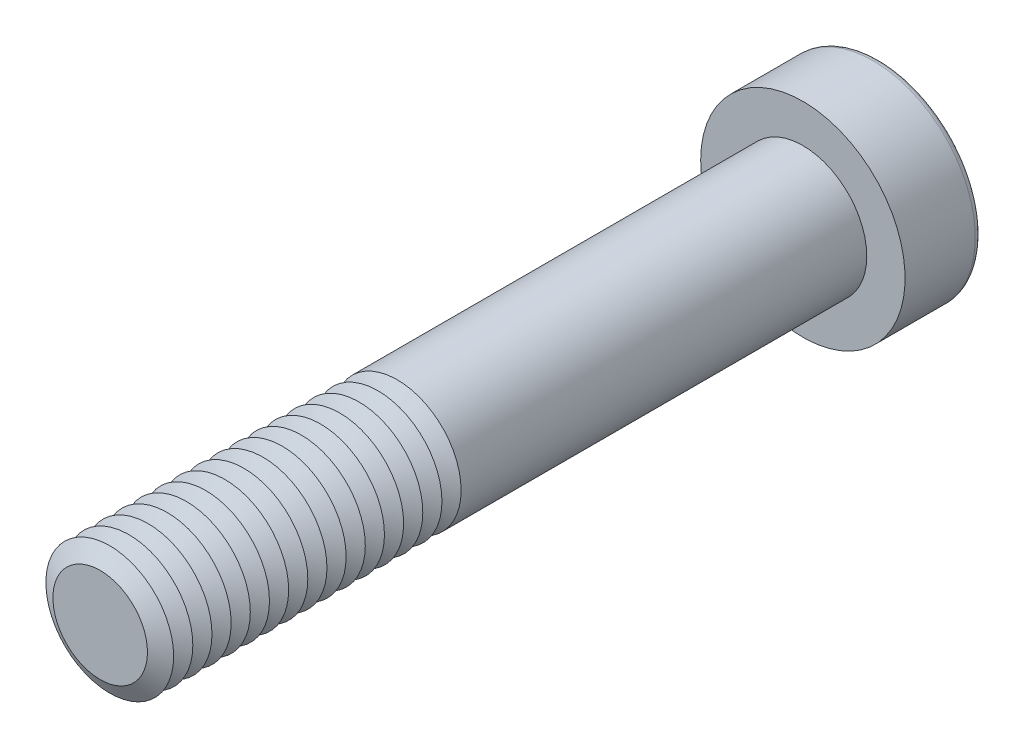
ISO-10303-21;
HEADER;
FILE_DESCRIPTION(('STEP AP214'),'2;1');
FILE_NAME('part.step','',(''),(''),'','','');
FILE_SCHEMA(('AUTOMOTIVE_DESIGN { 1 0 10303 214 1 1 1 1 }'));
ENDSEC;
DATA;
#1=APPLICATION_CONTEXT('core data for automotive mechanical design processes');
#2=APPLICATION_PROTOCOL_DEFINITION('international standard','automotive_design',2000,#1);
#3=PRODUCT_CONTEXT('',#1,'mechanical');
#4=PRODUCT('Part','Part','',(#3));
#5=PRODUCT_RELATED_PRODUCT_CATEGORY('part','',(#4));
#6=PRODUCT_DEFINITION_FORMATION('','',#4);
#7=PRODUCT_DEFINITION_CONTEXT('part definition',#1,'design');
#8=PRODUCT_DEFINITION('design','',#6,#7);
#9=PRODUCT_DEFINITION_SHAPE('','',#8);
#10=(LENGTH_UNIT() NAMED_UNIT(*) SI_UNIT(.MILLI.,.METRE.));
#11=(NAMED_UNIT(*) PLANE_ANGLE_UNIT() SI_UNIT($,.RADIAN.));
#12=(NAMED_UNIT(*) SI_UNIT($,.STERADIAN.) SOLID_ANGLE_UNIT());
#13=UNCERTAINTY_MEASURE_WITH_UNIT(LENGTH_MEASURE(1.E-05),#10,'distance_accuracy_value','');
#14=(GEOMETRIC_REPRESENTATION_CONTEXT(3) GLOBAL_UNCERTAINTY_ASSIGNED_CONTEXT((#13)) GLOBAL_UNIT_ASSIGNED_CONTEXT((#10,
#11,#12)) REPRESENTATION_CONTEXT('',''));
#15=CARTESIAN_POINT('',(0.,0.,0.));
#16=DIRECTION('',(0.,0.,1.));
#17=DIRECTION('',(1.,0.,0.));
#18=AXIS2_PLACEMENT_3D('',#15,#16,#17);
#19=CARTESIAN_POINT('',(0.,0.,49.75));
#20=DIRECTION('',(0.,0.,1.));
#21=DIRECTION('',(1.,0.,0.));
#22=AXIS2_PLACEMENT_3D('',#19,#20,#21);
#23=CONICAL_SURFACE('',#22,5.,1.0471975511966);
#24=CARTESIAN_POINT('',(0.,0.,49.));
#25=DIRECTION('',(0.,0.,1.));
#26=DIRECTION('',(1.,0.,0.));
#27=AXIS2_PLACEMENT_3D('',#24,#25,#26);
#28=CIRCLE('',#27,3.70096189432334);
#29=CARTESIAN_POINT('',(3.70096189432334,0.,49.));
#30=VERTEX_POINT('',#29);
#31=EDGE_CURVE('E313',#30,#30,#28,.T.);
#32=ORIENTED_EDGE('',*,*,#31,.T.);
#33=EDGE_LOOP('',(#32));
#34=FACE_BOUND('',#33,.T.);
#35=CARTESIAN_POINT('',(0.,0.,49.75));
#36=DIRECTION('',(0.,0.,1.));
#37=DIRECTION('',(1.,0.,0.));
#38=AXIS2_PLACEMENT_3D('',#35,#36,#37);
#39=CIRCLE('',#38,5.);
#40=CARTESIAN_POINT('',(5.,0.,49.75));
#41=VERTEX_POINT('',#40);
#42=EDGE_CURVE('E316',#41,#41,#39,.T.);
#43=ORIENTED_EDGE('',*,*,#42,.F.);
#44=EDGE_LOOP('',(#43));
#45=FACE_BOUND('',#44,.T.);
#46=ADVANCED_FACE('F39',(#34,#45),#23,.T.);
#47=CARTESIAN_POINT('',(0.,0.,49.));
#48=DIRECTION('',(0.,0.,-1.));
#49=DIRECTION('',(-1.,0.,0.));
#50=AXIS2_PLACEMENT_3D('',#47,#48,#49);
#51=CONICAL_SURFACE('',#50,3.70096189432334,1.0471975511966);
#52=CARTESIAN_POINT('',(0.,0.,48.25));
#53=DIRECTION('',(0.,0.,1.));
#54=DIRECTION('',(1.,0.,0.));
#55=AXIS2_PLACEMENT_3D('',#52,#53,#54);
#56=CIRCLE('',#55,5.);
#57=CARTESIAN_POINT('',(5.,0.,48.25));
#58=VERTEX_POINT('',#57);
#59=EDGE_CURVE('E324',#58,#58,#56,.T.);
#60=ORIENTED_EDGE('',*,*,#59,.T.);
#61=EDGE_LOOP('',(#60));
#62=FACE_BOUND('',#61,.T.);
#63=ORIENTED_EDGE('',*,*,#31,.F.);
#64=EDGE_LOOP('',(#63));
#65=FACE_BOUND('',#64,.T.);
#66=ADVANCED_FACE('F245',(#62,#65),#51,.T.);
#67=CARTESIAN_POINT('',(0.,0.,55.));
#68=DIRECTION('',(0.,0.,1.));
#69=DIRECTION('',(1.,0.,0.));
#70=AXIS2_PLACEMENT_3D('',#67,#68,#69);
#71=PLANE('',#70);
#72=CARTESIAN_POINT('',(0.,0.,55.));
#73=DIRECTION('',(0.,0.,1.));
#74=DIRECTION('',(1.,0.,0.));
#75=AXIS2_PLACEMENT_3D('',#72,#73,#74);
#76=CIRCLE('',#75,3.70096189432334);
#77=CARTESIAN_POINT('',(3.70096189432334,0.,55.));
#78=VERTEX_POINT('',#77);
#79=EDGE_CURVE('E174',#78,#78,#76,.T.);
#80=ORIENTED_EDGE('',*,*,#79,.T.);
#81=EDGE_LOOP('',(#80));
#82=FACE_BOUND('',#81,.T.);
#83=ADVANCED_FACE('F251',(#82),#71,.T.);
#84=CARTESIAN_POINT('',(0.,0.,55.));
#85=DIRECTION('',(0.,0.,-1.));
#86=DIRECTION('',(-1.,0.,0.));
#87=AXIS2_PLACEMENT_3D('',#84,#85,#86);
#88=CONICAL_SURFACE('',#87,3.70096189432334,1.0471975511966);
#89=CARTESIAN_POINT('',(0.,0.,54.25));
#90=DIRECTION('',(0.,0.,1.));
#91=DIRECTION('',(1.,0.,0.));
#92=AXIS2_PLACEMENT_3D('',#89,#90,#91);
#93=CIRCLE('',#92,5.);
#94=CARTESIAN_POINT('',(5.,0.,54.25));
#95=VERTEX_POINT('',#94);
#96=EDGE_CURVE('E291',#95,#95,#93,.T.);
#97=ORIENTED_EDGE('',*,*,#96,.T.);
#98=EDGE_LOOP('',(#97));
#99=FACE_BOUND('',#98,.T.);
#100=ORIENTED_EDGE('',*,*,#79,.F.);
#101=EDGE_LOOP('',(#100));
#102=FACE_BOUND('',#101,.T.);
#103=ADVANCED_FACE('F199',(#99,#102),#88,.T.);
#104=CARTESIAN_POINT('',(0.,0.,54.25));
#105=DIRECTION('',(0.,0.,1.));
#106=DIRECTION('',(1.,0.,0.));
#107=AXIS2_PLACEMENT_3D('',#104,#105,#106);
#108=CONICAL_SURFACE('',#107,5.,1.0471975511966);
#109=CARTESIAN_POINT('',(0.,0.,53.5));
#110=DIRECTION('',(0.,0.,1.));
#111=DIRECTION('',(1.,0.,0.));
#112=AXIS2_PLACEMENT_3D('',#109,#110,#111);
#113=CIRCLE('',#112,3.70096189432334);
#114=CARTESIAN_POINT('',(3.70096189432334,0.,53.5));
#115=VERTEX_POINT('',#114);
#116=EDGE_CURVE('E288',#115,#115,#113,.T.);
#117=ORIENTED_EDGE('',*,*,#116,.T.);
#118=EDGE_LOOP('',(#117));
#119=FACE_BOUND('',#118,.T.);
#120=ORIENTED_EDGE('',*,*,#96,.F.);
#121=EDGE_LOOP('',(#120));
#122=FACE_BOUND('',#121,.T.);
#123=ADVANCED_FACE('F277',(#119,#122),#108,.T.);
#124=CARTESIAN_POINT('',(0.,0.,53.5));
#125=DIRECTION('',(0.,0.,-1.));
#126=DIRECTION('',(-1.,0.,0.));
#127=AXIS2_PLACEMENT_3D('',#124,#125,#126);
#128=CONICAL_SURFACE('',#127,3.70096189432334,1.0471975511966);
#129=CARTESIAN_POINT('',(0.,0.,52.75));
#130=DIRECTION('',(0.,0.,1.));
#131=DIRECTION('',(1.,0.,0.));
#132=AXIS2_PLACEMENT_3D('',#129,#130,#131);
#133=CIRCLE('',#132,5.);
#134=CARTESIAN_POINT('',(5.,0.,52.75));
#135=VERTEX_POINT('',#134);
#136=EDGE_CURVE('E299',#135,#135,#133,.T.);
#137=ORIENTED_EDGE('',*,*,#136,.T.);
#138=EDGE_LOOP('',(#137));
#139=FACE_BOUND('',#138,.T.);
#140=ORIENTED_EDGE('',*,*,#116,.F.);
#141=EDGE_LOOP('',(#140));
#142=FACE_BOUND('',#141,.T.);
#143=ADVANCED_FACE('F274',(#139,#142),#128,.T.);
#144=CARTESIAN_POINT('',(0.,0.,52.75));
#145=DIRECTION('',(0.,0.,1.));
#146=DIRECTION('',(1.,0.,0.));
#147=AXIS2_PLACEMENT_3D('',#144,#145,#146);
#148=CONICAL_SURFACE('',#147,5.,1.0471975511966);
#149=CARTESIAN_POINT('',(0.,0.,52.));
#150=DIRECTION('',(0.,0.,1.));
#151=DIRECTION('',(1.,0.,0.));
#152=AXIS2_PLACEMENT_3D('',#149,#150,#151);
#153=CIRCLE('',#152,3.70096189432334);
#154=CARTESIAN_POINT('',(3.70096189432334,0.,52.));
#155=VERTEX_POINT('',#154);
#156=EDGE_CURVE('E293',#155,#155,#153,.T.);
#157=ORIENTED_EDGE('',*,*,#156,.T.);
#158=EDGE_LOOP('',(#157));
#159=FACE_BOUND('',#158,.T.);
#160=ORIENTED_EDGE('',*,*,#136,.F.);
#161=EDGE_LOOP('',(#160));
#162=FACE_BOUND('',#161,.T.);
#163=ADVANCED_FACE('F270',(#159,#162),#148,.T.);
#164=CARTESIAN_POINT('',(0.,0.,52.));
#165=DIRECTION('',(0.,0.,-1.));
#166=DIRECTION('',(-1.,0.,0.));
#167=AXIS2_PLACEMENT_3D('',#164,#165,#166);
#168=CONICAL_SURFACE('',#167,3.70096189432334,1.0471975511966);
#169=CARTESIAN_POINT('',(0.,0.,51.25));
#170=DIRECTION('',(0.,0.,1.));
#171=DIRECTION('',(1.,0.,0.));
#172=AXIS2_PLACEMENT_3D('',#169,#170,#171);
#173=CIRCLE('',#172,5.);
#174=CARTESIAN_POINT('',(5.,0.,51.25));
#175=VERTEX_POINT('',#174);
#176=EDGE_CURVE('E309',#175,#175,#173,.T.);
#177=ORIENTED_EDGE('',*,*,#176,.T.);
#178=EDGE_LOOP('',(#177));
#179=FACE_BOUND('',#178,.T.);
#180=ORIENTED_EDGE('',*,*,#156,.F.);
#181=EDGE_LOOP('',(#180));
#182=FACE_BOUND('',#181,.T.);
#183=ADVANCED_FACE('F266',(#179,#182),#168,.T.);
#184=CARTESIAN_POINT('',(0.,0.,51.25));
#185=DIRECTION('',(0.,0.,1.));
#186=DIRECTION('',(1.,0.,0.));
#187=AXIS2_PLACEMENT_3D('',#184,#185,#186);
#188=CONICAL_SURFACE('',#187,5.,1.0471975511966);
#189=CARTESIAN_POINT('',(0.,0.,50.5));
#190=DIRECTION('',(0.,0.,1.));
#191=DIRECTION('',(1.,0.,0.));
#192=AXIS2_PLACEMENT_3D('',#189,#190,#191);
#193=CIRCLE('',#192,3.70096189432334);
#194=CARTESIAN_POINT('',(3.70096189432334,0.,50.5));
#195=VERTEX_POINT('',#194);
#196=EDGE_CURVE('E305',#195,#195,#193,.T.);
#197=ORIENTED_EDGE('',*,*,#196,.T.);
#198=EDGE_LOOP('',(#197));
#199=FACE_BOUND('',#198,.T.);
#200=ORIENTED_EDGE('',*,*,#176,.F.);
#201=EDGE_LOOP('',(#200));
#202=FACE_BOUND('',#201,.T.);
#203=ADVANCED_FACE('F262',(#199,#202),#188,.T.);
#204=CARTESIAN_POINT('',(0.,0.,50.5));
#205=DIRECTION('',(0.,0.,-1.));
#206=DIRECTION('',(-1.,0.,0.));
#207=AXIS2_PLACEMENT_3D('',#204,#205,#206);
#208=CONICAL_SURFACE('',#207,3.70096189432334,1.0471975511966);
#209=ORIENTED_EDGE('',*,*,#42,.T.);
#210=EDGE_LOOP('',(#209));
#211=FACE_BOUND('',#210,.T.);
#212=ORIENTED_EDGE('',*,*,#196,.F.);
#213=EDGE_LOOP('',(#212));
#214=FACE_BOUND('',#213,.T.);
#215=ADVANCED_FACE('F258',(#211,#214),#208,.T.);
#216=CARTESIAN_POINT('',(0.,0.,48.25));
#217=DIRECTION('',(0.,0.,1.));
#218=DIRECTION('',(1.,0.,0.));
#219=AXIS2_PLACEMENT_3D('',#216,#217,#218);
#220=CONICAL_SURFACE('',#219,5.,1.0471975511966);
#221=CARTESIAN_POINT('',(0.,0.,47.5));
#222=DIRECTION('',(0.,0.,1.));
#223=DIRECTION('',(1.,0.,0.));
#224=AXIS2_PLACEMENT_3D('',#221,#222,#223);
#225=CIRCLE('',#224,3.70096189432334);
#226=CARTESIAN_POINT('',(3.70096189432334,0.,47.5));
#227=VERTEX_POINT('',#226);
#228=EDGE_CURVE('E320',#227,#227,#225,.T.);
#229=ORIENTED_EDGE('',*,*,#228,.T.);
#230=EDGE_LOOP('',(#229));
#231=FACE_BOUND('',#230,.T.);
#232=ORIENTED_EDGE('',*,*,#59,.F.);
#233=EDGE_LOOP('',(#232));
#234=FACE_BOUND('',#233,.T.);
#235=ADVANCED_FACE('F261',(#231,#234),#220,.T.);
#236=CARTESIAN_POINT('',(0.,0.,47.5));
#237=DIRECTION('',(0.,0.,-1.));
#238=DIRECTION('',(-1.,0.,0.));
#239=AXIS2_PLACEMENT_3D('',#236,#237,#238);
#240=CONICAL_SURFACE('',#239,3.70096189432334,1.0471975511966);
#241=CARTESIAN_POINT('',(0.,0.,46.75));
#242=DIRECTION('',(0.,0.,1.));
#243=DIRECTION('',(1.,0.,0.));
#244=AXIS2_PLACEMENT_3D('',#241,#242,#243);
#245=CIRCLE('',#244,5.);
#246=CARTESIAN_POINT('',(5.,0.,46.75));
#247=VERTEX_POINT('',#246);
#248=EDGE_CURVE('E331',#247,#247,#245,.T.);
#249=ORIENTED_EDGE('',*,*,#248,.T.);
#250=EDGE_LOOP('',(#249));
#251=FACE_BOUND('',#250,.T.);
#252=ORIENTED_EDGE('',*,*,#228,.F.);
#253=EDGE_LOOP('',(#252));
#254=FACE_BOUND('',#253,.T.);
#255=ADVANCED_FACE('F495',(#251,#254),#240,.T.);
#256=CARTESIAN_POINT('',(0.,0.,46.75));
#257=DIRECTION('',(0.,0.,1.));
#258=DIRECTION('',(1.,0.,0.));
#259=AXIS2_PLACEMENT_3D('',#256,#257,#258);
#260=CONICAL_SURFACE('',#259,5.,1.0471975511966);
#261=CARTESIAN_POINT('',(0.,0.,46.));
#262=DIRECTION('',(0.,0.,1.));
#263=DIRECTION('',(1.,0.,0.));
#264=AXIS2_PLACEMENT_3D('',#261,#262,#263);
#265=CIRCLE('',#264,3.70096189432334);
#266=CARTESIAN_POINT('',(3.70096189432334,0.,46.));
#267=VERTEX_POINT('',#266);
#268=EDGE_CURVE('E327',#267,#267,#265,.T.);
#269=ORIENTED_EDGE('',*,*,#268,.T.);
#270=EDGE_LOOP('',(#269));
#271=FACE_BOUND('',#270,.T.);
#272=ORIENTED_EDGE('',*,*,#248,.F.);
#273=EDGE_LOOP('',(#272));
#274=FACE_BOUND('',#273,.T.);
#275=ADVANCED_FACE('F491',(#271,#274),#260,.T.);
#276=CARTESIAN_POINT('',(0.,0.,46.));
#277=DIRECTION('',(0.,0.,-1.));
#278=DIRECTION('',(-1.,0.,0.));
#279=AXIS2_PLACEMENT_3D('',#276,#277,#278);
#280=CONICAL_SURFACE('',#279,3.70096189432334,1.0471975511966);
#281=CARTESIAN_POINT('',(0.,0.,45.25));
#282=DIRECTION('',(0.,0.,1.));
#283=DIRECTION('',(1.,0.,0.));
#284=AXIS2_PLACEMENT_3D('',#281,#282,#283);
#285=CIRCLE('',#284,5.);
#286=CARTESIAN_POINT('',(5.,0.,45.25));
#287=VERTEX_POINT('',#286);
#288=EDGE_CURVE('E339',#287,#287,#285,.T.);
#289=ORIENTED_EDGE('',*,*,#288,.T.);
#290=EDGE_LOOP('',(#289));
#291=FACE_BOUND('',#290,.T.);
#292=ORIENTED_EDGE('',*,*,#268,.F.);
#293=EDGE_LOOP('',(#292));
#294=FACE_BOUND('',#293,.T.);
#295=ADVANCED_FACE('F487',(#291,#294),#280,.T.);
#296=CARTESIAN_POINT('',(0.,0.,45.25));
#297=DIRECTION('',(0.,0.,1.));
#298=DIRECTION('',(1.,0.,0.));
#299=AXIS2_PLACEMENT_3D('',#296,#297,#298);
#300=CONICAL_SURFACE('',#299,5.,1.0471975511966);
#301=CARTESIAN_POINT('',(0.,0.,44.5));
#302=DIRECTION('',(0.,0.,1.));
#303=DIRECTION('',(1.,0.,0.));
#304=AXIS2_PLACEMENT_3D('',#301,#302,#303);
#305=CIRCLE('',#304,3.70096189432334);
#306=CARTESIAN_POINT('',(3.70096189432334,0.,44.5));
#307=VERTEX_POINT('',#306);
#308=EDGE_CURVE('E335',#307,#307,#305,.T.);
#309=ORIENTED_EDGE('',*,*,#308,.T.);
#310=EDGE_LOOP('',(#309));
#311=FACE_BOUND('',#310,.T.);
#312=ORIENTED_EDGE('',*,*,#288,.F.);
#313=EDGE_LOOP('',(#312));
#314=FACE_BOUND('',#313,.T.);
#315=ADVANCED_FACE('F483',(#311,#314),#300,.T.);
#316=CARTESIAN_POINT('',(0.,0.,44.5));
#317=DIRECTION('',(0.,0.,-1.));
#318=DIRECTION('',(-1.,0.,0.));
#319=AXIS2_PLACEMENT_3D('',#316,#317,#318);
#320=CONICAL_SURFACE('',#319,3.70096189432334,1.0471975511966);
#321=CARTESIAN_POINT('',(0.,0.,43.75));
#322=DIRECTION('',(0.,0.,1.));
#323=DIRECTION('',(1.,0.,0.));
#324=AXIS2_PLACEMENT_3D('',#321,#322,#323);
#325=CIRCLE('',#324,5.);
#326=CARTESIAN_POINT('',(5.,0.,43.75));
#327=VERTEX_POINT('',#326);
#328=EDGE_CURVE('E346',#327,#327,#325,.T.);
#329=ORIENTED_EDGE('',*,*,#328,.T.);
#330=EDGE_LOOP('',(#329));
#331=FACE_BOUND('',#330,.T.);
#332=ORIENTED_EDGE('',*,*,#308,.F.);
#333=EDGE_LOOP('',(#332));
#334=FACE_BOUND('',#333,.T.);
#335=ADVANCED_FACE('F479',(#331,#334),#320,.T.);
#336=CARTESIAN_POINT('',(0.,0.,43.75));
#337=DIRECTION('',(0.,0.,1.));
#338=DIRECTION('',(1.,0.,0.));
#339=AXIS2_PLACEMENT_3D('',#336,#337,#338);
#340=CONICAL_SURFACE('',#339,5.,1.0471975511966);
#341=CARTESIAN_POINT('',(0.,0.,43.));
#342=DIRECTION('',(0.,0.,1.));
#343=DIRECTION('',(1.,0.,0.));
#344=AXIS2_PLACEMENT_3D('',#341,#342,#343);
#345=CIRCLE('',#344,3.70096189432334);
#346=CARTESIAN_POINT('',(3.70096189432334,0.,43.));
#347=VERTEX_POINT('',#346);
#348=EDGE_CURVE('E342',#347,#347,#345,.T.);
#349=ORIENTED_EDGE('',*,*,#348,.T.);
#350=EDGE_LOOP('',(#349));
#351=FACE_BOUND('',#350,.T.);
#352=ORIENTED_EDGE('',*,*,#328,.F.);
#353=EDGE_LOOP('',(#352));
#354=FACE_BOUND('',#353,.T.);
#355=ADVANCED_FACE('F475',(#351,#354),#340,.T.);
#356=CARTESIAN_POINT('',(0.,0.,43.));
#357=DIRECTION('',(0.,0.,-1.));
#358=DIRECTION('',(-1.,0.,0.));
#359=AXIS2_PLACEMENT_3D('',#356,#357,#358);
#360=CONICAL_SURFACE('',#359,3.70096189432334,1.0471975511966);
#361=CARTESIAN_POINT('',(0.,0.,42.25));
#362=DIRECTION('',(0.,0.,1.));
#363=DIRECTION('',(1.,0.,0.));
#364=AXIS2_PLACEMENT_3D('',#361,#362,#363);
#365=CIRCLE('',#364,5.);
#366=CARTESIAN_POINT('',(5.,0.,42.25));
#367=VERTEX_POINT('',#366);
#368=EDGE_CURVE('E354',#367,#367,#365,.T.);
#369=ORIENTED_EDGE('',*,*,#368,.T.);
#370=EDGE_LOOP('',(#369));
#371=FACE_BOUND('',#370,.T.);
#372=ORIENTED_EDGE('',*,*,#348,.F.);
#373=EDGE_LOOP('',(#372));
#374=FACE_BOUND('',#373,.T.);
#375=ADVANCED_FACE('F471',(#371,#374),#360,.T.);
#376=CARTESIAN_POINT('',(0.,0.,42.25));
#377=DIRECTION('',(0.,0.,1.));
#378=DIRECTION('',(1.,0.,0.));
#379=AXIS2_PLACEMENT_3D('',#376,#377,#378);
#380=CONICAL_SURFACE('',#379,5.,1.0471975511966);
#381=CARTESIAN_POINT('',(0.,0.,41.5));
#382=DIRECTION('',(0.,0.,1.));
#383=DIRECTION('',(1.,0.,0.));
#384=AXIS2_PLACEMENT_3D('',#381,#382,#383);
#385=CIRCLE('',#384,3.70096189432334);
#386=CARTESIAN_POINT('',(3.70096189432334,0.,41.5));
#387=VERTEX_POINT('',#386);
#388=EDGE_CURVE('E350',#387,#387,#385,.T.);
#389=ORIENTED_EDGE('',*,*,#388,.T.);
#390=EDGE_LOOP('',(#389));
#391=FACE_BOUND('',#390,.T.);
#392=ORIENTED_EDGE('',*,*,#368,.F.);
#393=EDGE_LOOP('',(#392));
#394=FACE_BOUND('',#393,.T.);
#395=ADVANCED_FACE('F467',(#391,#394),#380,.T.);
#396=CARTESIAN_POINT('',(0.,0.,41.5));
#397=DIRECTION('',(0.,0.,-1.));
#398=DIRECTION('',(-1.,0.,0.));
#399=AXIS2_PLACEMENT_3D('',#396,#397,#398);
#400=CONICAL_SURFACE('',#399,3.70096189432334,1.0471975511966);
#401=CARTESIAN_POINT('',(0.,0.,40.75));
#402=DIRECTION('',(0.,0.,1.));
#403=DIRECTION('',(1.,0.,0.));
#404=AXIS2_PLACEMENT_3D('',#401,#402,#403);
#405=CIRCLE('',#404,5.);
#406=CARTESIAN_POINT('',(5.,0.,40.75));
#407=VERTEX_POINT('',#406);
#408=EDGE_CURVE('E362',#407,#407,#405,.T.);
#409=ORIENTED_EDGE('',*,*,#408,.T.);
#410=EDGE_LOOP('',(#409));
#411=FACE_BOUND('',#410,.T.);
#412=ORIENTED_EDGE('',*,*,#388,.F.);
#413=EDGE_LOOP('',(#412));
#414=FACE_BOUND('',#413,.T.);
#415=ADVANCED_FACE('F463',(#411,#414),#400,.T.);
#416=CARTESIAN_POINT('',(0.,0.,40.75));
#417=DIRECTION('',(0.,0.,1.));
#418=DIRECTION('',(1.,0.,0.));
#419=AXIS2_PLACEMENT_3D('',#416,#417,#418);
#420=CONICAL_SURFACE('',#419,5.,1.0471975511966);
#421=CARTESIAN_POINT('',(0.,0.,40.));
#422=DIRECTION('',(0.,0.,1.));
#423=DIRECTION('',(1.,0.,0.));
#424=AXIS2_PLACEMENT_3D('',#421,#422,#423);
#425=CIRCLE('',#424,3.70096189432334);
#426=CARTESIAN_POINT('',(3.70096189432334,0.,40.));
#427=VERTEX_POINT('',#426);
#428=EDGE_CURVE('E358',#427,#427,#425,.T.);
#429=ORIENTED_EDGE('',*,*,#428,.T.);
#430=EDGE_LOOP('',(#429));
#431=FACE_BOUND('',#430,.T.);
#432=ORIENTED_EDGE('',*,*,#408,.F.);
#433=EDGE_LOOP('',(#432));
#434=FACE_BOUND('',#433,.T.);
#435=ADVANCED_FACE('F459',(#431,#434),#420,.T.);
#436=CARTESIAN_POINT('',(0.,0.,40.));
#437=DIRECTION('',(0.,0.,-1.));
#438=DIRECTION('',(-1.,0.,0.));
#439=AXIS2_PLACEMENT_3D('',#436,#437,#438);
#440=CONICAL_SURFACE('',#439,3.70096189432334,1.0471975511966);
#441=CARTESIAN_POINT('',(0.,0.,39.25));
#442=DIRECTION('',(0.,0.,1.));
#443=DIRECTION('',(1.,0.,0.));
#444=AXIS2_PLACEMENT_3D('',#441,#442,#443);
#445=CIRCLE('',#444,5.);
#446=CARTESIAN_POINT('',(5.,0.,39.25));
#447=VERTEX_POINT('',#446);
#448=EDGE_CURVE('E370',#447,#447,#445,.T.);
#449=ORIENTED_EDGE('',*,*,#448,.T.);
#450=EDGE_LOOP('',(#449));
#451=FACE_BOUND('',#450,.T.);
#452=ORIENTED_EDGE('',*,*,#428,.F.);
#453=EDGE_LOOP('',(#452));
#454=FACE_BOUND('',#453,.T.);
#455=ADVANCED_FACE('F455',(#451,#454),#440,.T.);
#456=CARTESIAN_POINT('',(0.,0.,39.25));
#457=DIRECTION('',(0.,0.,1.));
#458=DIRECTION('',(1.,0.,0.));
#459=AXIS2_PLACEMENT_3D('',#456,#457,#458);
#460=CONICAL_SURFACE('',#459,5.,1.0471975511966);
#461=CARTESIAN_POINT('',(0.,0.,38.5));
#462=DIRECTION('',(0.,0.,1.));
#463=DIRECTION('',(1.,0.,0.));
#464=AXIS2_PLACEMENT_3D('',#461,#462,#463);
#465=CIRCLE('',#464,3.70096189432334);
#466=CARTESIAN_POINT('',(3.70096189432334,0.,38.5));
#467=VERTEX_POINT('',#466);
#468=EDGE_CURVE('E366',#467,#467,#465,.T.);
#469=ORIENTED_EDGE('',*,*,#468,.T.);
#470=EDGE_LOOP('',(#469));
#471=FACE_BOUND('',#470,.T.);
#472=ORIENTED_EDGE('',*,*,#448,.F.);
#473=EDGE_LOOP('',(#472));
#474=FACE_BOUND('',#473,.T.);
#475=ADVANCED_FACE('F451',(#471,#474),#460,.T.);
#476=CARTESIAN_POINT('',(0.,0.,38.5));
#477=DIRECTION('',(0.,0.,-1.));
#478=DIRECTION('',(-1.,0.,0.));
#479=AXIS2_PLACEMENT_3D('',#476,#477,#478);
#480=CONICAL_SURFACE('',#479,3.70096189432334,1.0471975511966);
#481=CARTESIAN_POINT('',(0.,0.,37.75));
#482=DIRECTION('',(0.,0.,1.));
#483=DIRECTION('',(1.,0.,0.));
#484=AXIS2_PLACEMENT_3D('',#481,#482,#483);
#485=CIRCLE('',#484,5.);
#486=CARTESIAN_POINT('',(5.,0.,37.75));
#487=VERTEX_POINT('',#486);
#488=EDGE_CURVE('E378',#487,#487,#485,.T.);
#489=ORIENTED_EDGE('',*,*,#488,.T.);
#490=EDGE_LOOP('',(#489));
#491=FACE_BOUND('',#490,.T.);
#492=ORIENTED_EDGE('',*,*,#468,.F.);
#493=EDGE_LOOP('',(#492));
#494=FACE_BOUND('',#493,.T.);
#495=ADVANCED_FACE('F447',(#491,#494),#480,.T.);
#496=CARTESIAN_POINT('',(0.,0.,37.75));
#497=DIRECTION('',(0.,0.,1.));
#498=DIRECTION('',(1.,0.,0.));
#499=AXIS2_PLACEMENT_3D('',#496,#497,#498);
#500=CONICAL_SURFACE('',#499,5.,1.0471975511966);
#501=CARTESIAN_POINT('',(0.,0.,37.));
#502=DIRECTION('',(0.,0.,1.));
#503=DIRECTION('',(1.,0.,0.));
#504=AXIS2_PLACEMENT_3D('',#501,#502,#503);
#505=CIRCLE('',#504,3.70096189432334);
#506=CARTESIAN_POINT('',(3.70096189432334,0.,37.));
#507=VERTEX_POINT('',#506);
#508=EDGE_CURVE('E374',#507,#507,#505,.T.);
#509=ORIENTED_EDGE('',*,*,#508,.T.);
#510=EDGE_LOOP('',(#509));
#511=FACE_BOUND('',#510,.T.);
#512=ORIENTED_EDGE('',*,*,#488,.F.);
#513=EDGE_LOOP('',(#512));
#514=FACE_BOUND('',#513,.T.);
#515=ADVANCED_FACE('F443',(#511,#514),#500,.T.);
#516=CARTESIAN_POINT('',(0.,0.,37.));
#517=DIRECTION('',(0.,0.,-1.));
#518=DIRECTION('',(-1.,0.,0.));
#519=AXIS2_PLACEMENT_3D('',#516,#517,#518);
#520=CONICAL_SURFACE('',#519,3.70096189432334,1.0471975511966);
#521=CARTESIAN_POINT('',(0.,0.,36.25));
#522=DIRECTION('',(0.,0.,1.));
#523=DIRECTION('',(1.,0.,0.));
#524=AXIS2_PLACEMENT_3D('',#521,#522,#523);
#525=CIRCLE('',#524,5.);
#526=CARTESIAN_POINT('',(5.,0.,36.25));
#527=VERTEX_POINT('',#526);
#528=EDGE_CURVE('E386',#527,#527,#525,.T.);
#529=ORIENTED_EDGE('',*,*,#528,.T.);
#530=EDGE_LOOP('',(#529));
#531=FACE_BOUND('',#530,.T.);
#532=ORIENTED_EDGE('',*,*,#508,.F.);
#533=EDGE_LOOP('',(#532));
#534=FACE_BOUND('',#533,.T.);
#535=ADVANCED_FACE('F439',(#531,#534),#520,.T.);
#536=CARTESIAN_POINT('',(0.,0.,36.25));
#537=DIRECTION('',(0.,0.,1.));
#538=DIRECTION('',(1.,0.,0.));
#539=AXIS2_PLACEMENT_3D('',#536,#537,#538);
#540=CONICAL_SURFACE('',#539,5.,1.0471975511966);
#541=CARTESIAN_POINT('',(0.,0.,35.5));
#542=DIRECTION('',(0.,0.,1.));
#543=DIRECTION('',(1.,0.,0.));
#544=AXIS2_PLACEMENT_3D('',#541,#542,#543);
#545=CIRCLE('',#544,3.70096189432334);
#546=CARTESIAN_POINT('',(3.70096189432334,0.,35.5));
#547=VERTEX_POINT('',#546);
#548=EDGE_CURVE('E382',#547,#547,#545,.T.);
#549=ORIENTED_EDGE('',*,*,#548,.T.);
#550=EDGE_LOOP('',(#549));
#551=FACE_BOUND('',#550,.T.);
#552=ORIENTED_EDGE('',*,*,#528,.F.);
#553=EDGE_LOOP('',(#552));
#554=FACE_BOUND('',#553,.T.);
#555=ADVANCED_FACE('F435',(#551,#554),#540,.T.);
#556=CARTESIAN_POINT('',(0.,0.,35.5));
#557=DIRECTION('',(0.,0.,-1.));
#558=DIRECTION('',(-1.,0.,0.));
#559=AXIS2_PLACEMENT_3D('',#556,#557,#558);
#560=CONICAL_SURFACE('',#559,3.70096189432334,1.0471975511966);
#561=CARTESIAN_POINT('',(0.,0.,34.75));
#562=DIRECTION('',(0.,0.,1.));
#563=DIRECTION('',(1.,0.,0.));
#564=AXIS2_PLACEMENT_3D('',#561,#562,#563);
#565=CIRCLE('',#564,5.);
#566=CARTESIAN_POINT('',(5.,0.,34.75));
#567=VERTEX_POINT('',#566);
#568=EDGE_CURVE('E394',#567,#567,#565,.T.);
#569=ORIENTED_EDGE('',*,*,#568,.T.);
#570=EDGE_LOOP('',(#569));
#571=FACE_BOUND('',#570,.T.);
#572=ORIENTED_EDGE('',*,*,#548,.F.);
#573=EDGE_LOOP('',(#572));
#574=FACE_BOUND('',#573,.T.);
#575=ADVANCED_FACE('F431',(#571,#574),#560,.T.);
#576=CARTESIAN_POINT('',(0.,0.,34.75));
#577=DIRECTION('',(0.,0.,1.));
#578=DIRECTION('',(1.,0.,0.));
#579=AXIS2_PLACEMENT_3D('',#576,#577,#578);
#580=CONICAL_SURFACE('',#579,5.,1.0471975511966);
#581=CARTESIAN_POINT('',(0.,0.,34.));
#582=DIRECTION('',(0.,0.,1.));
#583=DIRECTION('',(1.,0.,0.));
#584=AXIS2_PLACEMENT_3D('',#581,#582,#583);
#585=CIRCLE('',#584,3.70096189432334);
#586=CARTESIAN_POINT('',(3.70096189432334,0.,34.));
#587=VERTEX_POINT('',#586);
#588=EDGE_CURVE('E390',#587,#587,#585,.T.);
#589=ORIENTED_EDGE('',*,*,#588,.T.);
#590=EDGE_LOOP('',(#589));
#591=FACE_BOUND('',#590,.T.);
#592=ORIENTED_EDGE('',*,*,#568,.F.);
#593=EDGE_LOOP('',(#592));
#594=FACE_BOUND('',#593,.T.);
#595=ADVANCED_FACE('F426',(#591,#594),#580,.T.);
#596=CARTESIAN_POINT('',(0.,0.,34.));
#597=DIRECTION('',(0.,0.,-1.));
#598=DIRECTION('',(-1.,0.,0.));
#599=AXIS2_PLACEMENT_3D('',#596,#597,#598);
#600=CONICAL_SURFACE('',#599,3.70096189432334,1.0471975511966);
#601=CARTESIAN_POINT('',(0.,0.,33.25));
#602=DIRECTION('',(0.,0.,1.));
#603=DIRECTION('',(1.,0.,0.));
#604=AXIS2_PLACEMENT_3D('',#601,#602,#603);
#605=CIRCLE('',#604,5.);
#606=CARTESIAN_POINT('',(5.,0.,33.25));
#607=VERTEX_POINT('',#606);
#608=EDGE_CURVE('E406',#607,#607,#605,.T.);
#609=ORIENTED_EDGE('',*,*,#608,.T.);
#610=EDGE_LOOP('',(#609));
#611=FACE_BOUND('',#610,.T.);
#612=ORIENTED_EDGE('',*,*,#588,.F.);
#613=EDGE_LOOP('',(#612));
#614=FACE_BOUND('',#613,.T.);
#615=ADVANCED_FACE('F412',(#611,#614),#600,.T.);
#616=CARTESIAN_POINT('',(0.,0.,33.25));
#617=DIRECTION('',(0.,0.,1.));
#618=DIRECTION('',(1.,0.,0.));
#619=AXIS2_PLACEMENT_3D('',#616,#617,#618);
#620=CONICAL_SURFACE('',#619,5.,1.0471975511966);
#621=CARTESIAN_POINT('',(0.,0.,32.5));
#622=DIRECTION('',(0.,0.,1.));
#623=DIRECTION('',(1.,0.,0.));
#624=AXIS2_PLACEMENT_3D('',#621,#622,#623);
#625=CIRCLE('',#624,3.70096189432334);
#626=CARTESIAN_POINT('',(3.70096189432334,0.,32.5));
#627=VERTEX_POINT('',#626);
#628=EDGE_CURVE('E398',#627,#627,#625,.T.);
#629=ORIENTED_EDGE('',*,*,#628,.T.);
#630=EDGE_LOOP('',(#629));
#631=FACE_BOUND('',#630,.T.);
#632=ORIENTED_EDGE('',*,*,#608,.F.);
#633=EDGE_LOOP('',(#632));
#634=FACE_BOUND('',#633,.T.);
#635=ADVANCED_FACE('F415',(#631,#634),#620,.T.);
#636=CARTESIAN_POINT('',(0.,0.,32.5));
#637=DIRECTION('',(0.,0.,-1.));
#638=DIRECTION('',(-1.,0.,0.));
#639=AXIS2_PLACEMENT_3D('',#636,#637,#638);
#640=CONICAL_SURFACE('',#639,3.70096189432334,1.0471975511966);
#641=CARTESIAN_POINT('',(0.,0.,31.75));
#642=DIRECTION('',(0.,0.,1.));
#643=DIRECTION('',(1.,0.,0.));
#644=AXIS2_PLACEMENT_3D('',#641,#642,#643);
#645=CIRCLE('',#644,5.);
#646=CARTESIAN_POINT('',(5.,0.,31.75));
#647=VERTEX_POINT('',#646);
#648=EDGE_CURVE('E402',#647,#647,#645,.T.);
#649=ORIENTED_EDGE('',*,*,#648,.T.);
#650=EDGE_LOOP('',(#649));
#651=FACE_BOUND('',#650,.T.);
#652=ORIENTED_EDGE('',*,*,#628,.F.);
#653=EDGE_LOOP('',(#652));
#654=FACE_BOUND('',#653,.T.);
#655=ADVANCED_FACE('F417',(#651,#654),#640,.T.);
#656=CARTESIAN_POINT('',(0.,0.,-0.75));
#657=DIRECTION('',(0.,0.,-1.));
#658=DIRECTION('',(-1.,0.,0.));
#659=AXIS2_PLACEMENT_3D('',#656,#657,#658);
#660=CONICAL_SURFACE('',#659,3.5,1.0471975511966);
#661=CARTESIAN_POINT('',(0.,0.,1.27072594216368));
#662=VERTEX_POINT('',#661);
#663=VERTEX_LOOP('',#662);
#664=FACE_BOUND('',#663,.T.);
#665=CARTESIAN_POINT('',(0.,0.,-0.75));
#666=DIRECTION('',(0.,0.,-1.));
#667=DIRECTION('',(-1.,0.,0.));
#668=AXIS2_PLACEMENT_3D('',#665,#666,#667);
#669=CIRCLE('',#668,3.5);
#670=CARTESIAN_POINT('',(-3.03108891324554,1.75,-0.75));
#671=VERTEX_POINT('',#670);
#672=CARTESIAN_POINT('',(0.,3.5,-0.75));
#673=VERTEX_POINT('',#672);
#674=EDGE_CURVE('E149',#671,#673,#669,.T.);
#675=ORIENTED_EDGE('',*,*,#674,.T.);
#676=CARTESIAN_POINT('',(0.,0.,-0.75));
#677=DIRECTION('',(0.,0.,-1.));
#678=DIRECTION('',(-1.,0.,0.));
#679=AXIS2_PLACEMENT_3D('',#676,#677,#678);
#680=CIRCLE('',#679,3.5);
#681=CARTESIAN_POINT('',(3.03108891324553,1.75,-0.75));
#682=VERTEX_POINT('',#681);
#683=EDGE_CURVE('E54',#673,#682,#680,.T.);
#684=ORIENTED_EDGE('',*,*,#683,.T.);
#685=CARTESIAN_POINT('',(3.03108891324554,-1.75,-0.75));
#686=VERTEX_POINT('',#685);
#687=EDGE_CURVE('E998',#682,#686,#680,.T.);
#688=ORIENTED_EDGE('',*,*,#687,.T.);
#689=CARTESIAN_POINT('',(0.,-3.5,-0.75));
#690=VERTEX_POINT('',#689);
#691=EDGE_CURVE('E996',#686,#690,#680,.T.);
#692=ORIENTED_EDGE('',*,*,#691,.T.);
#693=CARTESIAN_POINT('',(-3.03108891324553,-1.75,-0.75));
#694=VERTEX_POINT('',#693);
#695=EDGE_CURVE('E991',#690,#694,#680,.T.);
#696=ORIENTED_EDGE('',*,*,#695,.T.);
#697=EDGE_CURVE('E990',#694,#671,#680,.T.);
#698=ORIENTED_EDGE('',*,*,#697,.T.);
#699=EDGE_LOOP('',(#675,#684,#688,#692,#696,#698));
#700=FACE_BOUND('',#699,.T.);
#701=ADVANCED_FACE('F201',(#664,#700),#660,.F.);
#702=CARTESIAN_POINT('',(0.,0.,-0.75));
#703=DIRECTION('',(0.,0.,-1.));
#704=DIRECTION('',(-1.,0.,0.));
#705=AXIS2_PLACEMENT_3D('',#702,#703,#704);
#706=PLANE('',#705);
#707=ORIENTED_EDGE('',*,*,#683,.F.);
#708=DIRECTION('',(1.,0.,0.));
#709=VECTOR('',#708,1.);
#710=CARTESIAN_POINT('',(-2.02072594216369,3.5,-0.75));
#711=LINE('',#710,#709);
#712=CARTESIAN_POINT('',(2.02072594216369,3.5,-0.75));
#713=VERTEX_POINT('',#712);
#714=EDGE_CURVE('E1041',#673,#713,#711,.T.);
#715=ORIENTED_EDGE('',*,*,#714,.T.);
#716=DIRECTION('',(0.5,-0.866025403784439,0.));
#717=VECTOR('',#716,1.);
#718=CARTESIAN_POINT('',(2.02072594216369,3.5,-0.75));
#719=LINE('',#718,#717);
#720=EDGE_CURVE('E155',#713,#682,#719,.T.);
#721=ORIENTED_EDGE('',*,*,#720,.T.);
#722=EDGE_LOOP('',(#707,#715,#721));
#723=FACE_BOUND('',#722,.T.);
#724=ADVANCED_FACE('F584',(#723),#706,.T.);
#725=ORIENTED_EDGE('',*,*,#687,.F.);
#726=CARTESIAN_POINT('',(4.04145188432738,0.,-0.75));
#727=VERTEX_POINT('',#726);
#728=EDGE_CURVE('E1034',#682,#727,#719,.T.);
#729=ORIENTED_EDGE('',*,*,#728,.T.);
#730=DIRECTION('',(-0.5,-0.866025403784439,0.));
#731=VECTOR('',#730,1.);
#732=CARTESIAN_POINT('',(4.04145188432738,0.,-0.75));
#733=LINE('',#732,#731);
#734=EDGE_CURVE('E1011',#727,#686,#733,.T.);
#735=ORIENTED_EDGE('',*,*,#734,.T.);
#736=EDGE_LOOP('',(#725,#729,#735));
#737=FACE_BOUND('',#736,.T.);
#738=ADVANCED_FACE('F594',(#737),#706,.T.);
#739=ORIENTED_EDGE('',*,*,#691,.F.);
#740=CARTESIAN_POINT('',(2.02072594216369,-3.5,-0.75));
#741=VERTEX_POINT('',#740);
#742=EDGE_CURVE('E1013',#686,#741,#733,.T.);
#743=ORIENTED_EDGE('',*,*,#742,.T.);
#744=DIRECTION('',(-1.,0.,0.));
#745=VECTOR('',#744,1.);
#746=CARTESIAN_POINT('',(2.02072594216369,-3.5,-0.75));
#747=LINE('',#746,#745);
#748=EDGE_CURVE('E964',#741,#690,#747,.T.);
#749=ORIENTED_EDGE('',*,*,#748,.T.);
#750=EDGE_LOOP('',(#739,#743,#749));
#751=FACE_BOUND('',#750,.T.);
#752=ADVANCED_FACE('F604',(#751),#706,.T.);
#753=ORIENTED_EDGE('',*,*,#695,.F.);
#754=CARTESIAN_POINT('',(-2.02072594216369,-3.5,-0.75));
#755=VERTEX_POINT('',#754);
#756=EDGE_CURVE('E1008',#690,#755,#747,.T.);
#757=ORIENTED_EDGE('',*,*,#756,.T.);
#758=DIRECTION('',(-0.5,0.866025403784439,0.));
#759=VECTOR('',#758,1.);
#760=CARTESIAN_POINT('',(-2.02072594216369,-3.5,-0.75));
#761=LINE('',#760,#759);
#762=EDGE_CURVE('E1010',#755,#694,#761,.T.);
#763=ORIENTED_EDGE('',*,*,#762,.T.);
#764=EDGE_LOOP('',(#753,#757,#763));
#765=FACE_BOUND('',#764,.T.);
#766=ADVANCED_FACE('F612',(#765),#706,.T.);
#767=ORIENTED_EDGE('',*,*,#697,.F.);
#768=CARTESIAN_POINT('',(-4.04145188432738,0.,-0.75));
#769=VERTEX_POINT('',#768);
#770=EDGE_CURVE('E1014',#694,#769,#761,.T.);
#771=ORIENTED_EDGE('',*,*,#770,.T.);
#772=DIRECTION('',(0.5,0.866025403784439,0.));
#773=VECTOR('',#772,1.);
#774=CARTESIAN_POINT('',(-4.04145188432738,0.,-0.75));
#775=LINE('',#774,#773);
#776=EDGE_CURVE('E158',#769,#671,#775,.T.);
#777=ORIENTED_EDGE('',*,*,#776,.T.);
#778=EDGE_LOOP('',(#767,#771,#777));
#779=FACE_BOUND('',#778,.T.);
#780=ADVANCED_FACE('F231',(#779),#706,.T.);
#781=ORIENTED_EDGE('',*,*,#674,.F.);
#782=CARTESIAN_POINT('',(-2.02072594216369,3.5,-0.75));
#783=VERTEX_POINT('',#782);
#784=EDGE_CURVE('E1021',#671,#783,#775,.T.);
#785=ORIENTED_EDGE('',*,*,#784,.T.);
#786=EDGE_CURVE('E1039',#783,#673,#711,.T.);
#787=ORIENTED_EDGE('',*,*,#786,.T.);
#788=EDGE_LOOP('',(#781,#785,#787));
#789=FACE_BOUND('',#788,.T.);
#790=ADVANCED_FACE('F596',(#789),#706,.T.);
#791=CARTESIAN_POINT('',(-2.02072594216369,3.5,-0.75));
#792=DIRECTION('',(0.,1.,0.));
#793=DIRECTION('',(-1.,0.,0.));
#794=AXIS2_PLACEMENT_3D('',#791,#792,#793);
#795=PLANE('',#794);
#796=DIRECTION('',(0.,0.,-1.));
#797=VECTOR('',#796,1.);
#798=CARTESIAN_POINT('',(-2.02072594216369,3.5,-0.75));
#799=LINE('',#798,#797);
#800=CARTESIAN_POINT('',(-2.02072594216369,3.5,-6.));
#801=VERTEX_POINT('',#800);
#802=EDGE_CURVE('E147',#783,#801,#799,.T.);
#803=ORIENTED_EDGE('',*,*,#802,.T.);
#804=CARTESIAN_POINT('',(-5.27521327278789,3.5,-6.613404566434));
#805=CARTESIAN_POINT('',(-5.11717138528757,3.5,-6.57812703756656));
#806=CARTESIAN_POINT('',(-4.95902873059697,3.5,-6.5432936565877));
#807=CARTESIAN_POINT('',(-4.64249233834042,3.5,-6.47475322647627));
#808=CARTESIAN_POINT('',(-4.48409858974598,3.5,-6.44104622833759));
#809=CARTESIAN_POINT('',(-4.16686075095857,3.5,-6.37496567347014));
#810=CARTESIAN_POINT('',(-4.00801636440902,3.5,-6.34259353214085));
#811=CARTESIAN_POINT('',(-3.68999232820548,3.5,-6.27954992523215));
#812=CARTESIAN_POINT('',(-3.53081268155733,3.5,-6.24887844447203));
#813=CARTESIAN_POINT('',(-3.05545711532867,3.5,-6.16049717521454));
#814=CARTESIAN_POINT('',(-2.73870333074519,3.5,-6.10583257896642));
#815=CARTESIAN_POINT('',(-2.10326379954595,3.5,-6.00899390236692));
#816=CARTESIAN_POINT('',(-1.78457845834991,3.5,-5.9668172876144));
#817=CARTESIAN_POINT('',(-1.30331397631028,3.5,-5.91703310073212));
#818=CARTESIAN_POINT('',(-1.14143900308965,3.5,-5.90264327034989));
#819=CARTESIAN_POINT('',(-0.817296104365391,3.5,-5.87924021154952));
#820=CARTESIAN_POINT('',(-0.655028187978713,3.5,-5.87022685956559));
#821=CARTESIAN_POINT('',(-0.330337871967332,3.5,-5.8581019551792));
#822=CARTESIAN_POINT('',(-0.167915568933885,3.5,-5.85498786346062));
#823=CARTESIAN_POINT('',(0.156931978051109,3.5,-5.85485125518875));
#824=CARTESIAN_POINT('',(0.319357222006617,3.5,-5.8578287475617));
#825=CARTESIAN_POINT('',(0.644649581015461,3.5,-5.86971076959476));
#826=CARTESIAN_POINT('',(0.807515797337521,3.5,-5.87863941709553));
#827=CARTESIAN_POINT('',(1.13286152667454,3.5,-5.90192432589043));
#828=CARTESIAN_POINT('',(1.29534101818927,3.5,-5.91628088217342));
#829=CARTESIAN_POINT('',(1.61990955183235,3.5,-5.94971371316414));
#830=CARTESIAN_POINT('',(1.78199828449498,3.5,-5.96879294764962));
#831=CARTESIAN_POINT('',(2.10565606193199,3.5,-6.01089893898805));
#832=CARTESIAN_POINT('',(2.26722510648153,3.5,-6.03392569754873));
#833=CARTESIAN_POINT('',(2.59408673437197,3.5,-6.08385328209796));
#834=CARTESIAN_POINT('',(2.75936612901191,3.5,-6.11083971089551));
#835=CARTESIAN_POINT('',(3.08945524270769,3.5,-6.16755337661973));
#836=CARTESIAN_POINT('',(3.25426494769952,3.5,-6.19728069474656));
#837=CARTESIAN_POINT('',(3.74811783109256,3.5,-6.28973245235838));
#838=CARTESIAN_POINT('',(4.07654810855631,3.5,-6.35572082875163));
#839=CARTESIAN_POINT('',(4.73230999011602,3.5,-6.49329874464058));
#840=CARTESIAN_POINT('',(5.05964125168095,3.5,-6.56488988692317));
#841=CARTESIAN_POINT('',(5.71347161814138,3.5,-6.71179760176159));
#842=CARTESIAN_POINT('',(6.03997070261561,3.5,-6.78711426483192));
#843=CARTESIAN_POINT('',(6.68838444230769,3.5,-6.93936666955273));
#844=CARTESIAN_POINT('',(7.01030641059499,3.5,-7.01627142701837));
#845=CARTESIAN_POINT('',(7.65372712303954,3.5,-7.17185944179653));
#846=CARTESIAN_POINT('',(7.97522585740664,3.5,-7.25054273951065));
#847=CARTESIAN_POINT('',(8.61745492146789,3.5,-7.409094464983));
#848=CARTESIAN_POINT('',(8.93818569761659,3.5,-7.48896108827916));
#849=CARTESIAN_POINT('',(9.57938765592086,3.5,-7.64968154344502));
#850=CARTESIAN_POINT('',(9.89985884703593,3.5,-7.73053533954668));
#851=CARTESIAN_POINT('',(10.2202418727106,3.5,-7.81173318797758));
#852=B_SPLINE_CURVE_WITH_KNOTS('',3,(#804,#805,#806,#807,#808,#809,#810,#811,#812,#813,#814,
#815,#816,#817,#818,#819,#820,#821,#822,#823,#824,#825,#826,#827,#828,#829,#830,#831,#832,#833,
#834,#835,#836,#837,#838,#839,#840,#841,#842,#843,#844,#845,#846,#847,#848,#849,#850,#851),
.UNSPECIFIED.,.F.,.F.,(4,2,2,2,2,2,2,2,2,2,2,2,2,2,2,2,2,2,2,2,2,2,2,4),(0.,0.485795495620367,
0.971612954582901,1.45793295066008,1.94424860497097,2.90841266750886,3.87238092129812,
4.35984584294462,4.84729956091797,5.33454340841,5.82178796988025,6.31101925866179,
6.80027713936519,7.28984242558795,7.77940792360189,8.28178329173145,8.78417354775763,
9.78906542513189,10.7942458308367,11.7994506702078,12.7923858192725,13.7853435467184,
14.7769174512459,15.7684555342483),.UNSPECIFIED.);
#853=CARTESIAN_POINT('',(2.02072594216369,3.5,-6.));
#854=VERTEX_POINT('',#853);
#855=EDGE_CURVE('E124',#801,#854,#852,.T.);
#856=ORIENTED_EDGE('',*,*,#855,.T.);
#857=DIRECTION('',(0.,0.,-1.));
#858=VECTOR('',#857,1.);
#859=CARTESIAN_POINT('',(2.02072594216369,3.5,-0.75));
#860=LINE('',#859,#858);
#861=EDGE_CURVE('E143',#713,#854,#860,.T.);
#862=ORIENTED_EDGE('',*,*,#861,.F.);
#863=ORIENTED_EDGE('',*,*,#714,.F.);
#864=ORIENTED_EDGE('',*,*,#786,.F.);
#865=EDGE_LOOP('',(#803,#856,#862,#863,#864));
#866=FACE_BOUND('',#865,.T.);
#867=ADVANCED_FACE('F141',(#866),#795,.F.);
#868=CARTESIAN_POINT('',(2.02072594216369,3.5,-0.75));
#869=DIRECTION('',(0.866025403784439,0.5,0.));
#870=DIRECTION('',(-0.5,0.866025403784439,0.));
#871=AXIS2_PLACEMENT_3D('',#868,#869,#870);
#872=PLANE('',#871);
#873=ORIENTED_EDGE('',*,*,#861,.T.);
#874=CARTESIAN_POINT('',(2.02061047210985,3.5002,-6.00003094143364));
#875=CARTESIAN_POINT('',(2.10453570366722,3.35483723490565,-5.97753281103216));
#876=CARTESIAN_POINT('',(2.18861311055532,3.20921089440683,-5.95710815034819));
#877=CARTESIAN_POINT('',(2.35706487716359,2.91744387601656,-5.92122385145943));
#878=CARTESIAN_POINT('',(2.44143934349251,2.77130301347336,-5.90576623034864));
#879=CARTESIAN_POINT('',(2.6099736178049,2.47939308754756,-5.88071849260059));
#880=CARTESIAN_POINT('',(2.69413228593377,2.33362599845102,-5.87109850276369));
#881=CARTESIAN_POINT('',(2.86255695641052,2.04190591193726,-5.85819907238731));
#882=CARTESIAN_POINT('',(2.94682293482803,1.89595295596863,-5.85491840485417));
#883=CARTESIAN_POINT('',(3.11535489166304,1.60404704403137,-5.85491840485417));
#884=CARTESIAN_POINT('',(3.19962087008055,1.45809408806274,-5.85819907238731));
#885=CARTESIAN_POINT('',(3.3680455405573,1.16637400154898,-5.87109850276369));
#886=CARTESIAN_POINT('',(3.45220420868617,1.02060691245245,-5.88071849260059));
#887=CARTESIAN_POINT('',(3.62073848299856,0.728696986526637,-5.90576623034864));
#888=CARTESIAN_POINT('',(3.70511294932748,0.582556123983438,-5.92122385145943));
#889=CARTESIAN_POINT('',(3.87356471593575,0.290789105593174,-5.95710815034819));
#890=CARTESIAN_POINT('',(3.95764212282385,0.145162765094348,-5.97753281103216));
#891=CARTESIAN_POINT('',(4.04156735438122,-0.000199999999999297,-6.00003094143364));
#892=B_SPLINE_CURVE_WITH_KNOTS('',3,(#874,#875,#876,#877,#878,#879,#880,#881,#882,#883,#884,
#885,#886,#887,#888,#889,#890,#891),.UNSPECIFIED.,.F.,.F.,(4,2,2,2,2,2,2,2,4),(0.,
0.508081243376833,1.01636855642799,1.52203235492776,2.02759827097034,2.53316418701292,
3.03882798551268,3.54711529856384,4.05519654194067),.UNSPECIFIED.);
#893=CARTESIAN_POINT('',(4.04145188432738,0.,-6.));
#894=VERTEX_POINT('',#893);
#895=EDGE_CURVE('E11',#854,#894,#892,.T.);
#896=ORIENTED_EDGE('',*,*,#895,.T.);
#897=DIRECTION('',(0.,0.,-1.));
#898=VECTOR('',#897,1.);
#899=CARTESIAN_POINT('',(4.04145188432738,0.,-0.75));
#900=LINE('',#899,#898);
#901=EDGE_CURVE('E157',#727,#894,#900,.T.);
#902=ORIENTED_EDGE('',*,*,#901,.F.);
#903=ORIENTED_EDGE('',*,*,#728,.F.);
#904=ORIENTED_EDGE('',*,*,#720,.F.);
#905=EDGE_LOOP('',(#873,#896,#902,#903,#904));
#906=FACE_BOUND('',#905,.T.);
#907=ADVANCED_FACE('F152',(#906),#872,.F.);
#908=CARTESIAN_POINT('',(4.04145188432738,0.,-0.75));
#909=DIRECTION('',(0.866025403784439,-0.5,0.));
#910=DIRECTION('',(0.5,0.866025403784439,0.));
#911=AXIS2_PLACEMENT_3D('',#908,#909,#910);
#912=PLANE('',#911);
#913=ORIENTED_EDGE('',*,*,#901,.T.);
#914=CARTESIAN_POINT('',(4.04156735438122,0.000200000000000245,-6.00003094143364));
#915=CARTESIAN_POINT('',(3.95764212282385,-0.145162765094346,-5.97753281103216));
#916=CARTESIAN_POINT('',(3.87356471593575,-0.290789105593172,-5.95710815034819));
#917=CARTESIAN_POINT('',(3.70511294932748,-0.582556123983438,-5.92122385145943));
#918=CARTESIAN_POINT('',(3.62073848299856,-0.728696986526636,-5.90576623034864));
#919=CARTESIAN_POINT('',(3.45220420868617,-1.02060691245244,-5.88071849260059));
#920=CARTESIAN_POINT('',(3.3680455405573,-1.16637400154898,-5.87109850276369));
#921=CARTESIAN_POINT('',(3.19962087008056,-1.45809408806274,-5.85819907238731));
#922=CARTESIAN_POINT('',(3.11535489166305,-1.60404704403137,-5.85491840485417));
#923=CARTESIAN_POINT('',(2.94682293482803,-1.89595295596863,-5.85491840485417));
#924=CARTESIAN_POINT('',(2.86255695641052,-2.04190591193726,-5.85819907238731));
#925=CARTESIAN_POINT('',(2.69413228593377,-2.33362599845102,-5.87109850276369));
#926=CARTESIAN_POINT('',(2.6099736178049,-2.47939308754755,-5.88071849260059));
#927=CARTESIAN_POINT('',(2.44143934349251,-2.77130301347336,-5.90576623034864));
#928=CARTESIAN_POINT('',(2.35706487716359,-2.91744387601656,-5.92122385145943));
#929=CARTESIAN_POINT('',(2.18861311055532,-3.20921089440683,-5.95710815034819));
#930=CARTESIAN_POINT('',(2.10453570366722,-3.35483723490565,-5.97753281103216));
#931=CARTESIAN_POINT('',(2.02061047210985,-3.5002,-6.00003094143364));
#932=B_SPLINE_CURVE_WITH_KNOTS('',3,(#914,#915,#916,#917,#918,#919,#920,#921,#922,#923,#924,
#925,#926,#927,#928,#929,#930,#931),.UNSPECIFIED.,.F.,.F.,(4,2,2,2,2,2,2,2,4),(0.,
0.508081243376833,1.01636855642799,1.52203235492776,2.02759827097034,2.53316418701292,
3.03882798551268,3.54711529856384,4.05519654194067),.UNSPECIFIED.);
#933=CARTESIAN_POINT('',(2.02072594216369,-3.5,-6.));
#934=VERTEX_POINT('',#933);
#935=EDGE_CURVE('E173',#894,#934,#932,.T.);
#936=ORIENTED_EDGE('',*,*,#935,.T.);
#937=DIRECTION('',(0.,0.,-1.));
#938=VECTOR('',#937,1.);
#939=CARTESIAN_POINT('',(2.02072594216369,-3.5,-0.75));
#940=LINE('',#939,#938);
#941=EDGE_CURVE('E959',#741,#934,#940,.T.);
#942=ORIENTED_EDGE('',*,*,#941,.F.);
#943=ORIENTED_EDGE('',*,*,#742,.F.);
#944=ORIENTED_EDGE('',*,*,#734,.F.);
#945=EDGE_LOOP('',(#913,#936,#942,#943,#944));
#946=FACE_BOUND('',#945,.T.);
#947=ADVANCED_FACE('F191',(#946),#912,.F.);
#948=CARTESIAN_POINT('',(2.02072594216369,-3.5,-0.75));
#949=DIRECTION('',(0.,-1.,0.));
#950=DIRECTION('',(1.,0.,0.));
#951=AXIS2_PLACEMENT_3D('',#948,#949,#950);
#952=PLANE('',#951);
#953=ORIENTED_EDGE('',*,*,#941,.T.);
#954=CARTESIAN_POINT('',(-5.27521327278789,-3.5,-6.613404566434));
#955=CARTESIAN_POINT('',(-5.11717138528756,-3.5,-6.57812703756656));
#956=CARTESIAN_POINT('',(-4.95902873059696,-3.5,-6.5432936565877));
#957=CARTESIAN_POINT('',(-4.64249233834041,-3.5,-6.47475322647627));
#958=CARTESIAN_POINT('',(-4.48409858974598,-3.5,-6.44104622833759));
#959=CARTESIAN_POINT('',(-4.16686075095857,-3.5,-6.37496567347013));
#960=CARTESIAN_POINT('',(-4.00801636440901,-3.5,-6.34259353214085));
#961=CARTESIAN_POINT('',(-3.68999232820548,-3.5,-6.27954992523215));
#962=CARTESIAN_POINT('',(-3.53081268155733,-3.5,-6.24887844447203));
#963=CARTESIAN_POINT('',(-3.05545711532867,-3.5,-6.16049717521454));
#964=CARTESIAN_POINT('',(-2.73870333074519,-3.5,-6.10583257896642));
#965=CARTESIAN_POINT('',(-2.10326379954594,-3.5,-6.00899390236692));
#966=CARTESIAN_POINT('',(-1.78457845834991,-3.5,-5.9668172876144));
#967=CARTESIAN_POINT('',(-1.30331397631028,-3.5,-5.91703310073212));
#968=CARTESIAN_POINT('',(-1.14143900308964,-3.5,-5.90264327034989));
#969=CARTESIAN_POINT('',(-0.81729610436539,-3.5,-5.87924021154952));
#970=CARTESIAN_POINT('',(-0.655028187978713,-3.5,-5.87022685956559));
#971=CARTESIAN_POINT('',(-0.330337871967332,-3.5,-5.8581019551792));
#972=CARTESIAN_POINT('',(-0.167915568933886,-3.5,-5.85498786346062));
#973=CARTESIAN_POINT('',(0.156931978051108,-3.5,-5.85485125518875));
#974=CARTESIAN_POINT('',(0.319357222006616,-3.5,-5.8578287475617));
#975=CARTESIAN_POINT('',(0.64464958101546,-3.5,-5.86971076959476));
#976=CARTESIAN_POINT('',(0.807515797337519,-3.5,-5.87863941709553));
#977=CARTESIAN_POINT('',(1.13286152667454,-3.5,-5.90192432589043));
#978=CARTESIAN_POINT('',(1.29534101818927,-3.5,-5.91628088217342));
#979=CARTESIAN_POINT('',(1.61990955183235,-3.5,-5.94971371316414));
#980=CARTESIAN_POINT('',(1.78199828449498,-3.5,-5.96879294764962));
#981=CARTESIAN_POINT('',(2.10565606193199,-3.5,-6.01089893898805));
#982=CARTESIAN_POINT('',(2.26722510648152,-3.5,-6.03392569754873));
#983=CARTESIAN_POINT('',(2.59408673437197,-3.5,-6.08385328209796));
#984=CARTESIAN_POINT('',(2.75936612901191,-3.5,-6.11083971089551));
#985=CARTESIAN_POINT('',(3.08945524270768,-3.5,-6.16755337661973));
#986=CARTESIAN_POINT('',(3.25426494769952,-3.5,-6.19728069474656));
#987=CARTESIAN_POINT('',(3.74811783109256,-3.5,-6.28973245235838));
#988=CARTESIAN_POINT('',(4.0765481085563,-3.5,-6.35572082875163));
#989=CARTESIAN_POINT('',(4.73230999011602,-3.5,-6.49329874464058));
#990=CARTESIAN_POINT('',(5.05964125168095,-3.5,-6.56488988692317));
#991=CARTESIAN_POINT('',(5.71347161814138,-3.5,-6.71179760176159));
#992=CARTESIAN_POINT('',(6.03997070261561,-3.5,-6.78711426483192));
#993=CARTESIAN_POINT('',(6.68838444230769,-3.5,-6.93936666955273));
#994=CARTESIAN_POINT('',(7.01030641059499,-3.5,-7.01627142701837));
#995=CARTESIAN_POINT('',(7.65372712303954,-3.5,-7.17185944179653));
#996=CARTESIAN_POINT('',(7.97522585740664,-3.5,-7.25054273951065));
#997=CARTESIAN_POINT('',(8.61745492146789,-3.5,-7.409094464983));
#998=CARTESIAN_POINT('',(8.93818569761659,-3.5,-7.48896108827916));
#999=CARTESIAN_POINT('',(9.57938765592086,-3.5,-7.64968154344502));
#1000=CARTESIAN_POINT('',(9.89985884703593,-3.5,-7.73053533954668));
#1001=CARTESIAN_POINT('',(10.2202418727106,-3.5,-7.81173318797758));
#1002=B_SPLINE_CURVE_WITH_KNOTS('',3,(#954,#955,#956,#957,#958,#959,#960,#961,#962,#963,#964,
#965,#966,#967,#968,#969,#970,#971,#972,#973,#974,#975,#976,#977,#978,#979,#980,#981,#982,#983,
#984,#985,#986,#987,#988,#989,#990,#991,#992,#993,#994,#995,#996,#997,#998,#999,#1000,#1001),
.UNSPECIFIED.,.F.,.F.,(4,2,2,2,2,2,2,2,2,2,2,2,2,2,2,2,2,2,2,2,2,2,2,4),(0.,0.485795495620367,
0.971612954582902,1.45793295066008,1.94424860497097,2.90841266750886,3.87238092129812,
4.35984584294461,4.84729956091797,5.33454340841,5.82178796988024,6.31101925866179,
6.80027713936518,7.28984242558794,7.77940792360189,8.28178329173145,8.78417354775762,
9.78906542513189,10.7942458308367,11.7994506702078,12.7923858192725,13.7853435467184,
14.7769174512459,15.7684555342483),.UNSPECIFIED.);
#1003=CARTESIAN_POINT('',(-2.02072594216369,-3.5,-6.));
#1004=VERTEX_POINT('',#1003);
#1005=EDGE_CURVE('E184',#934,#1004,#1002,.F.);
#1006=ORIENTED_EDGE('',*,*,#1005,.T.);
#1007=DIRECTION('',(0.,0.,-1.));
#1008=VECTOR('',#1007,1.);
#1009=CARTESIAN_POINT('',(-2.02072594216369,-3.5,-0.75));
#1010=LINE('',#1009,#1008);
#1011=EDGE_CURVE('E966',#755,#1004,#1010,.T.);
#1012=ORIENTED_EDGE('',*,*,#1011,.F.);
#1013=ORIENTED_EDGE('',*,*,#756,.F.);
#1014=ORIENTED_EDGE('',*,*,#748,.F.);
#1015=EDGE_LOOP('',(#953,#1006,#1012,#1013,#1014));
#1016=FACE_BOUND('',#1015,.T.);
#1017=ADVANCED_FACE('F234',(#1016),#952,.F.);
#1018=CARTESIAN_POINT('',(-2.02072594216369,-3.5,-0.75));
#1019=DIRECTION('',(-0.866025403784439,-0.5,0.));
#1020=DIRECTION('',(0.5,-0.866025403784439,0.));
#1021=AXIS2_PLACEMENT_3D('',#1018,#1019,#1020);
#1022=PLANE('',#1021);
#1023=ORIENTED_EDGE('',*,*,#1011,.T.);
#1024=CARTESIAN_POINT('',(-2.02061047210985,-3.5002,-6.00003094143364));
#1025=CARTESIAN_POINT('',(-2.10453570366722,-3.35483723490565,-5.97753281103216));
#1026=CARTESIAN_POINT('',(-2.18861311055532,-3.20921089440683,-5.95710815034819));
#1027=CARTESIAN_POINT('',(-2.35706487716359,-2.91744387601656,-5.92122385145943));
#1028=CARTESIAN_POINT('',(-2.44143934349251,-2.77130301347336,-5.90576623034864));
#1029=CARTESIAN_POINT('',(-2.6099736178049,-2.47939308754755,-5.88071849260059));
#1030=CARTESIAN_POINT('',(-2.69413228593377,-2.33362599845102,-5.87109850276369));
#1031=CARTESIAN_POINT('',(-2.86255695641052,-2.04190591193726,-5.85819907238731));
#1032=CARTESIAN_POINT('',(-2.94682293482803,-1.89595295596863,-5.85491840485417));
#1033=CARTESIAN_POINT('',(-3.11535489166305,-1.60404704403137,-5.85491840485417));
#1034=CARTESIAN_POINT('',(-3.19962087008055,-1.45809408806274,-5.85819907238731));
#1035=CARTESIAN_POINT('',(-3.3680455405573,-1.16637400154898,-5.87109850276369));
#1036=CARTESIAN_POINT('',(-3.45220420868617,-1.02060691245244,-5.88071849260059));
#1037=CARTESIAN_POINT('',(-3.62073848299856,-0.728696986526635,-5.90576623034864));
#1038=CARTESIAN_POINT('',(-3.70511294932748,-0.582556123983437,-5.92122385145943));
#1039=CARTESIAN_POINT('',(-3.87356471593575,-0.290789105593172,-5.95710815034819));
#1040=CARTESIAN_POINT('',(-3.95764212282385,-0.145162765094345,-5.97753281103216));
#1041=CARTESIAN_POINT('',(-4.04156735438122,0.000200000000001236,-6.00003094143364));
#1042=B_SPLINE_CURVE_WITH_KNOTS('',3,(#1024,#1025,#1026,#1027,#1028,#1029,#1030,#1031,#1032,
#1033,#1034,#1035,#1036,#1037,#1038,#1039,#1040,#1041),.UNSPECIFIED.,.F.,.F.,(4,2,2,2,2,2,2,2,
4),(0.,0.508081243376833,1.01636855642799,1.52203235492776,2.02759827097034,2.53316418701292,
3.03882798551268,3.54711529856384,4.05519654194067),.UNSPECIFIED.);
#1043=CARTESIAN_POINT('',(-4.04145188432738,0.,-6.));
#1044=VERTEX_POINT('',#1043);
#1045=EDGE_CURVE('E208',#1004,#1044,#1042,.T.);
#1046=ORIENTED_EDGE('',*,*,#1045,.T.);
#1047=DIRECTION('',(0.,0.,-1.));
#1048=VECTOR('',#1047,1.);
#1049=CARTESIAN_POINT('',(-4.04145188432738,0.,-0.75));
#1050=LINE('',#1049,#1048);
#1051=EDGE_CURVE('E970',#769,#1044,#1050,.T.);
#1052=ORIENTED_EDGE('',*,*,#1051,.F.);
#1053=ORIENTED_EDGE('',*,*,#770,.F.);
#1054=ORIENTED_EDGE('',*,*,#762,.F.);
#1055=EDGE_LOOP('',(#1023,#1046,#1052,#1053,#1054));
#1056=FACE_BOUND('',#1055,.T.);
#1057=ADVANCED_FACE('F229',(#1056),#1022,.F.);
#1058=CARTESIAN_POINT('',(-4.04145188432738,0.,-0.75));
#1059=DIRECTION('',(-0.866025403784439,0.5,0.));
#1060=DIRECTION('',(-0.5,-0.866025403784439,0.));
#1061=AXIS2_PLACEMENT_3D('',#1058,#1059,#1060);
#1062=PLANE('',#1061);
#1063=ORIENTED_EDGE('',*,*,#1051,.T.);
#1064=CARTESIAN_POINT('',(-4.04156735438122,-0.000199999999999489,-6.00003094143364));
#1065=CARTESIAN_POINT('',(-3.95764212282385,0.145162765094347,-5.97753281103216));
#1066=CARTESIAN_POINT('',(-3.87356471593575,0.290789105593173,-5.95710815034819));
#1067=CARTESIAN_POINT('',(-3.70511294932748,0.582556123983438,-5.92122385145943));
#1068=CARTESIAN_POINT('',(-3.62073848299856,0.728696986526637,-5.90576623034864));
#1069=CARTESIAN_POINT('',(-3.45220420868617,1.02060691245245,-5.88071849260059));
#1070=CARTESIAN_POINT('',(-3.3680455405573,1.16637400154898,-5.87109850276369));
#1071=CARTESIAN_POINT('',(-3.19962087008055,1.45809408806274,-5.85819907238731));
#1072=CARTESIAN_POINT('',(-3.11535489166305,1.60404704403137,-5.85491840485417));
#1073=CARTESIAN_POINT('',(-2.94682293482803,1.89595295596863,-5.85491840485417));
#1074=CARTESIAN_POINT('',(-2.86255695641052,2.04190591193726,-5.85819907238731));
#1075=CARTESIAN_POINT('',(-2.69413228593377,2.33362599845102,-5.87109850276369));
#1076=CARTESIAN_POINT('',(-2.6099736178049,2.47939308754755,-5.88071849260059));
#1077=CARTESIAN_POINT('',(-2.44143934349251,2.77130301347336,-5.90576623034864));
#1078=CARTESIAN_POINT('',(-2.35706487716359,2.91744387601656,-5.92122385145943));
#1079=CARTESIAN_POINT('',(-2.18861311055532,3.20921089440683,-5.95710815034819));
#1080=CARTESIAN_POINT('',(-2.10453570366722,3.35483723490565,-5.97753281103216));
#1081=CARTESIAN_POINT('',(-2.02061047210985,3.5002,-6.00003094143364));
#1082=B_SPLINE_CURVE_WITH_KNOTS('',3,(#1064,#1065,#1066,#1067,#1068,#1069,#1070,#1071,#1072,
#1073,#1074,#1075,#1076,#1077,#1078,#1079,#1080,#1081),.UNSPECIFIED.,.F.,.F.,(4,2,2,2,2,2,2,2,
4),(0.,0.508081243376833,1.01636855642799,1.52203235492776,2.02759827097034,2.53316418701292,
3.03882798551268,3.54711529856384,4.05519654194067),.UNSPECIFIED.);
#1083=EDGE_CURVE('E150',#1044,#801,#1082,.T.);
#1084=ORIENTED_EDGE('',*,*,#1083,.T.);
#1085=ORIENTED_EDGE('',*,*,#802,.F.);
#1086=ORIENTED_EDGE('',*,*,#784,.F.);
#1087=ORIENTED_EDGE('',*,*,#776,.F.);
#1088=EDGE_LOOP('',(#1063,#1084,#1085,#1086,#1087));
#1089=FACE_BOUND('',#1088,.T.);
#1090=ADVANCED_FACE('F197',(#1089),#1062,.F.);
#1091=CARTESIAN_POINT('',(0.,0.,-6.));
#1092=DIRECTION('',(0.,0.,-1.));
#1093=DIRECTION('',(-1.,0.,0.));
#1094=AXIS2_PLACEMENT_3D('',#1091,#1092,#1093);
#1095=CONICAL_SURFACE('',#1094,4.04145188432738,1.30899693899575);
#1096=CARTESIAN_POINT('',(0.,0.,-6.));
#1097=DIRECTION('',(0.,0.,-1.));
#1098=DIRECTION('',(-1.,0.,0.));
#1099=AXIS2_PLACEMENT_3D('',#1096,#1097,#1098);
#1100=CIRCLE('',#1099,4.04145188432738);
#1101=EDGE_CURVE('E120',#801,#854,#1100,.T.);
#1102=ORIENTED_EDGE('',*,*,#1101,.T.);
#1103=ORIENTED_EDGE('',*,*,#855,.F.);
#1104=EDGE_LOOP('',(#1102,#1103));
#1105=FACE_BOUND('',#1104,.T.);
#1106=ADVANCED_FACE('F122',(#1105),#1095,.F.);
#1107=EDGE_CURVE('E129',#854,#894,#1100,.T.);
#1108=ORIENTED_EDGE('',*,*,#1107,.T.);
#1109=ORIENTED_EDGE('',*,*,#895,.F.);
#1110=EDGE_LOOP('',(#1108,#1109));
#1111=FACE_BOUND('',#1110,.T.);
#1112=ADVANCED_FACE('F133',(#1111),#1095,.F.);
#1113=EDGE_CURVE('E164',#894,#934,#1100,.T.);
#1114=ORIENTED_EDGE('',*,*,#1113,.T.);
#1115=ORIENTED_EDGE('',*,*,#935,.F.);
#1116=EDGE_LOOP('',(#1114,#1115));
#1117=FACE_BOUND('',#1116,.T.);
#1118=ADVANCED_FACE('F677',(#1117),#1095,.F.);
#1119=EDGE_CURVE('E169',#934,#1004,#1100,.T.);
#1120=ORIENTED_EDGE('',*,*,#1119,.T.);
#1121=ORIENTED_EDGE('',*,*,#1005,.F.);
#1122=EDGE_LOOP('',(#1120,#1121));
#1123=FACE_BOUND('',#1122,.T.);
#1124=ADVANCED_FACE('F684',(#1123),#1095,.F.);
#1125=EDGE_CURVE('E67',#1004,#1044,#1100,.T.);
#1126=ORIENTED_EDGE('',*,*,#1125,.T.);
#1127=ORIENTED_EDGE('',*,*,#1045,.F.);
#1128=EDGE_LOOP('',(#1126,#1127));
#1129=FACE_BOUND('',#1128,.T.);
#1130=ADVANCED_FACE('F692',(#1129),#1095,.F.);
#1131=EDGE_CURVE('E60',#1044,#801,#1100,.T.);
#1132=ORIENTED_EDGE('',*,*,#1131,.T.);
#1133=ORIENTED_EDGE('',*,*,#1083,.F.);
#1134=EDGE_LOOP('',(#1132,#1133));
#1135=FACE_BOUND('',#1134,.T.);
#1136=ADVANCED_FACE('F198',(#1135),#1095,.F.);
#1137=CARTESIAN_POINT('',(0.,0.,-6.));
#1138=DIRECTION('',(0.,0.,-1.));
#1139=DIRECTION('',(-1.,0.,0.));
#1140=AXIS2_PLACEMENT_3D('',#1137,#1138,#1139);
#1141=PLANE('',#1140);
#1142=ORIENTED_EDGE('',*,*,#1131,.F.);
#1143=ORIENTED_EDGE('',*,*,#1125,.F.);
#1144=ORIENTED_EDGE('',*,*,#1119,.F.);
#1145=ORIENTED_EDGE('',*,*,#1113,.F.);
#1146=ORIENTED_EDGE('',*,*,#1107,.F.);
#1147=ORIENTED_EDGE('',*,*,#1101,.F.);
#1148=EDGE_LOOP('',(#1142,#1143,#1144,#1145,#1146,#1147));
#1149=FACE_BOUND('',#1148,.T.);
#1150=CARTESIAN_POINT('',(0.,0.,-6.));
#1151=DIRECTION('',(0.,0.,-1.));
#1152=DIRECTION('',(-1.,0.,0.));
#1153=AXIS2_PLACEMENT_3D('',#1150,#1151,#1152);
#1154=CIRCLE('',#1153,7.5);
#1155=CARTESIAN_POINT('',(-7.5,0.,-6.));
#1156=VERTEX_POINT('',#1155);
#1157=EDGE_CURVE('E984',#1156,#1156,#1154,.T.);
#1158=ORIENTED_EDGE('',*,*,#1157,.T.);
#1159=EDGE_LOOP('',(#1158));
#1160=FACE_BOUND('',#1159,.T.);
#1161=ADVANCED_FACE('F161',(#1149,#1160),#1141,.T.);
#1162=CARTESIAN_POINT('',(0.,0.,-5.5));
#1163=DIRECTION('',(0.,0.,-1.));
#1164=DIRECTION('',(-1.,0.,0.));
#1165=AXIS2_PLACEMENT_3D('',#1162,#1163,#1164);
#1166=TOROIDAL_SURFACE('',#1165,7.5,0.5);
#1167=CARTESIAN_POINT('',(0.,0.,-5.5));
#1168=DIRECTION('',(0.,0.,-1.));
#1169=DIRECTION('',(-1.,0.,0.));
#1170=AXIS2_PLACEMENT_3D('',#1167,#1168,#1169);
#1171=CIRCLE('',#1170,8.);
#1172=CARTESIAN_POINT('',(-8.,0.,-5.5));
#1173=VERTEX_POINT('',#1172);
#1174=EDGE_CURVE('E987',#1173,#1173,#1171,.F.);
#1175=ORIENTED_EDGE('',*,*,#1174,.F.);
#1176=EDGE_LOOP('',(#1175));
#1177=FACE_BOUND('',#1176,.T.);
#1178=ORIENTED_EDGE('',*,*,#1157,.F.);
#1179=EDGE_LOOP('',(#1178));
#1180=FACE_BOUND('',#1179,.T.);
#1181=ADVANCED_FACE('F41',(#1177,#1180),#1166,.T.);
#1182=CARTESIAN_POINT('',(0.,0.,-6.));
#1183=DIRECTION('',(0.,0.,1.));
#1184=DIRECTION('',(1.,0.,0.));
#1185=AXIS2_PLACEMENT_3D('',#1182,#1183,#1184);
#1186=CYLINDRICAL_SURFACE('',#1185,8.);
#1187=ORIENTED_EDGE('',*,*,#1174,.T.);
#1188=EDGE_LOOP('',(#1187));
#1189=FACE_BOUND('',#1188,.T.);
#1190=CARTESIAN_POINT('',(0.,0.,0.));
#1191=DIRECTION('',(0.,0.,-1.));
#1192=DIRECTION('',(-1.,0.,0.));
#1193=AXIS2_PLACEMENT_3D('',#1190,#1191,#1192);
#1194=CIRCLE('',#1193,8.);
#1195=CARTESIAN_POINT('',(-8.,0.,0.));
#1196=VERTEX_POINT('',#1195);
#1197=EDGE_CURVE('E976',#1196,#1196,#1194,.T.);
#1198=ORIENTED_EDGE('',*,*,#1197,.T.);
#1199=EDGE_LOOP('',(#1198));
#1200=FACE_BOUND('',#1199,.T.);
#1201=ADVANCED_FACE('F716',(#1189,#1200),#1186,.T.);
#1202=CARTESIAN_POINT('',(0.,0.,0.));
#1203=DIRECTION('',(0.,0.,-1.));
#1204=DIRECTION('',(-1.,0.,0.));
#1205=AXIS2_PLACEMENT_3D('',#1202,#1203,#1204);
#1206=PLANE('',#1205);
#1207=CARTESIAN_POINT('',(0.,0.,0.));
#1208=DIRECTION('',(0.,0.,1.));
#1209=DIRECTION('',(1.,0.,0.));
#1210=AXIS2_PLACEMENT_3D('',#1207,#1208,#1209);
#1211=CIRCLE('',#1210,5.);
#1212=CARTESIAN_POINT('',(5.,0.,0.));
#1213=VERTEX_POINT('',#1212);
#1214=EDGE_CURVE('E980',#1213,#1213,#1211,.T.);
#1215=ORIENTED_EDGE('',*,*,#1214,.F.);
#1216=EDGE_LOOP('',(#1215));
#1217=FACE_BOUND('',#1216,.T.);
#1218=ORIENTED_EDGE('',*,*,#1197,.F.);
#1219=EDGE_LOOP('',(#1218));
#1220=FACE_BOUND('',#1219,.T.);
#1221=ADVANCED_FACE('F724',(#1217,#1220),#1206,.F.);
#1222=CARTESIAN_POINT('',(0.,0.,55.));
#1223=DIRECTION('',(0.,0.,-1.));
#1224=DIRECTION('',(-1.,0.,0.));
#1225=AXIS2_PLACEMENT_3D('',#1222,#1223,#1224);
#1226=CYLINDRICAL_SURFACE('',#1225,5.);
#1227=ORIENTED_EDGE('',*,*,#1214,.T.);
#1228=EDGE_LOOP('',(#1227));
#1229=FACE_BOUND('',#1228,.T.);
#1230=ORIENTED_EDGE('',*,*,#648,.F.);
#1231=EDGE_LOOP('',(#1230));
#1232=FACE_BOUND('',#1231,.T.);
#1233=ADVANCED_FACE('F733',(#1229,#1232),#1226,.T.);
#1234=CLOSED_SHELL('',(#46,#66,#83,#103,#123,#143,#163,#183,#203,#215,#235,#255,#275,#295,#315,
#335,#355,#375,#395,#415,#435,#455,#475,#495,#515,#535,#555,#575,#595,#615,#635,#655,#701,#724,
#738,#752,#766,#780,#790,#867,#907,#947,#1017,#1057,#1090,#1106,#1112,#1118,#1124,#1130,#1136,
#1161,#1181,#1201,#1221,#1233));
#1235=MANIFOLD_SOLID_BREP('B2',#1234);
#1236=ADVANCED_BREP_SHAPE_REPRESENTATION('',(#18,#1235),#14);
#1237=SHAPE_DEFINITION_REPRESENTATION(#9,#1236);
ENDSEC;
END-ISO-10303-21;
